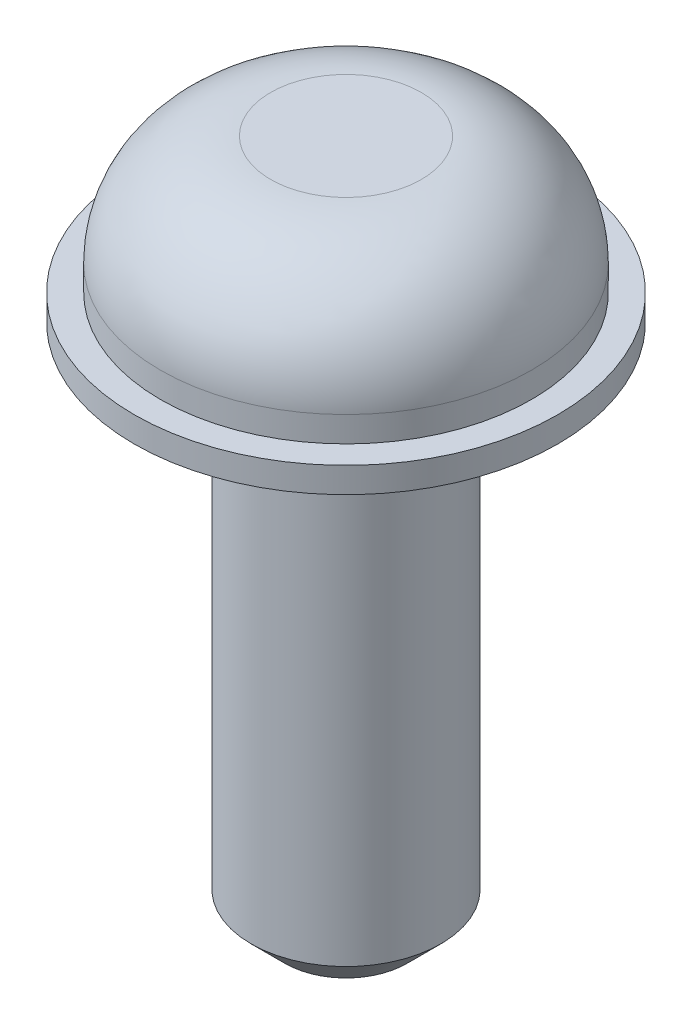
from build123d import *

# Parameters (mm, degrees)
FILLET1_R     = 1.651
CHAMFER1_SIZE = 0.508


with BuildPart() as part:
    # Sketch1 → Revolve1 (revolve)
    with BuildSketch(Plane(origin=(0, 0, 0), x_dir=(0, 0, -1), z_dir=(1, 0, 0)), mode=Mode.PRIVATE) as revolve1_sk:
        Polygon((0, 2.413), (2.7813, 2.413), (2.7813, 0.381), (3.175, 0.381), (3.175, 0), (1.4224, 0), (1.4224, -7.874), (0, -7.874), align=None)
    revolve(revolve1_sk.sketch.rotate(Axis((0, 10.708502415, 0), (0, -1, 0)), 180), axis=Axis((0, 10.708502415, 0), (0, -1, 0)))

    # Fillet1
    fillet1_edges = [part.edges().sort_by_distance(p)[0] for p in [
        (0, 2.413, -2.7813),
    ]]
    fillet(fillet1_edges, radius=FILLET1_R)

    # Chamfer1
    chamfer1_edges = [part.edges().sort_by_distance(p)[0] for p in [
        (0, -7.874, -1.4224),
    ]]
    chamfer(chamfer1_edges, length=CHAMFER1_SIZE)


solid = part.part
